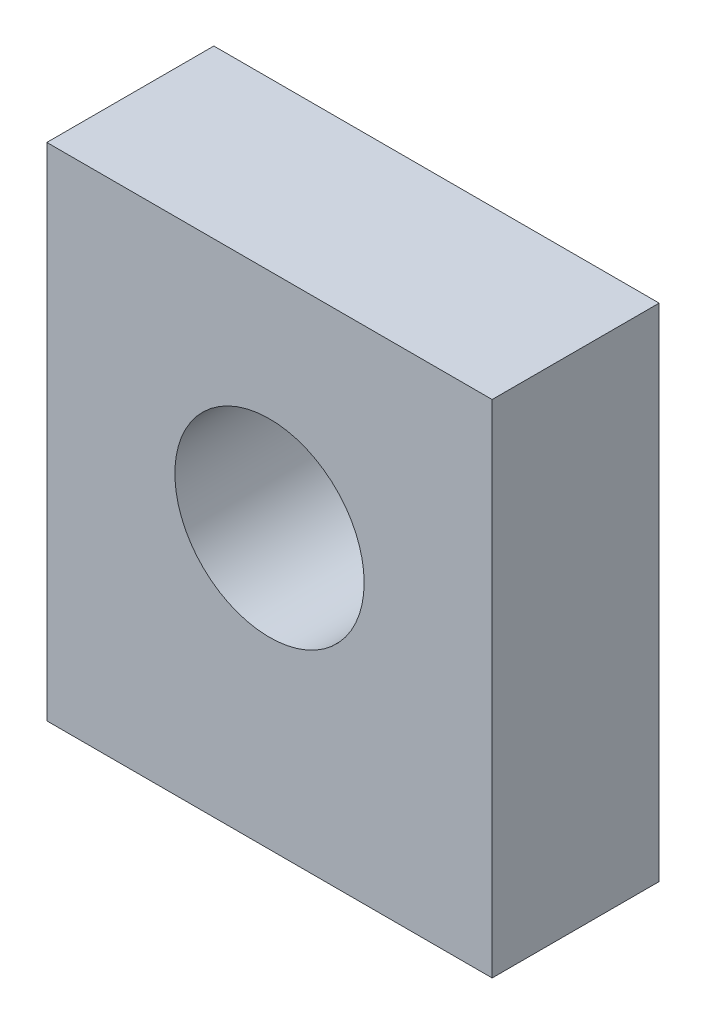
ISO-10303-21;
HEADER;
FILE_DESCRIPTION(('STEP AP214'),'2;1');
FILE_NAME('part.step','',(''),(''),'','','');
FILE_SCHEMA(('AUTOMOTIVE_DESIGN { 1 0 10303 214 1 1 1 1 }'));
ENDSEC;
DATA;
#1=APPLICATION_CONTEXT('core data for automotive mechanical design processes');
#2=APPLICATION_PROTOCOL_DEFINITION('international standard','automotive_design',2000,#1);
#3=PRODUCT_CONTEXT('',#1,'mechanical');
#4=PRODUCT('Part','Part','',(#3));
#5=PRODUCT_RELATED_PRODUCT_CATEGORY('part','',(#4));
#6=PRODUCT_DEFINITION_FORMATION('','',#4);
#7=PRODUCT_DEFINITION_CONTEXT('part definition',#1,'design');
#8=PRODUCT_DEFINITION('design','',#6,#7);
#9=PRODUCT_DEFINITION_SHAPE('','',#8);
#10=(LENGTH_UNIT() NAMED_UNIT(*) SI_UNIT(.MILLI.,.METRE.));
#11=(NAMED_UNIT(*) PLANE_ANGLE_UNIT() SI_UNIT($,.RADIAN.));
#12=(NAMED_UNIT(*) SI_UNIT($,.STERADIAN.) SOLID_ANGLE_UNIT());
#13=UNCERTAINTY_MEASURE_WITH_UNIT(LENGTH_MEASURE(1.E-05),#10,'distance_accuracy_value','');
#14=(GEOMETRIC_REPRESENTATION_CONTEXT(3) GLOBAL_UNCERTAINTY_ASSIGNED_CONTEXT((#13)) GLOBAL_UNIT_ASSIGNED_CONTEXT((#10,
#11,#12)) REPRESENTATION_CONTEXT('',''));
#15=CARTESIAN_POINT('',(0.,0.,0.));
#16=DIRECTION('',(0.,0.,1.));
#17=DIRECTION('',(1.,0.,0.));
#18=AXIS2_PLACEMENT_3D('',#15,#16,#17);
#19=CARTESIAN_POINT('',(0.,0.,3.));
#20=DIRECTION('',(0.,0.,1.));
#21=DIRECTION('',(1.,0.,0.));
#22=AXIS2_PLACEMENT_3D('',#19,#20,#21);
#23=PLANE('',#22);
#24=DIRECTION('',(0.,-1.,0.));
#25=VECTOR('',#24,1.);
#26=CARTESIAN_POINT('',(-4.,4.,3.));
#27=LINE('',#26,#25);
#28=CARTESIAN_POINT('',(-4.,4.,3.));
#29=VERTEX_POINT('',#28);
#30=CARTESIAN_POINT('',(-4.,-5.,3.));
#31=VERTEX_POINT('',#30);
#32=EDGE_CURVE('E95',#29,#31,#27,.T.);
#33=ORIENTED_EDGE('',*,*,#32,.T.);
#34=DIRECTION('',(1.,0.,0.));
#35=VECTOR('',#34,1.);
#36=CARTESIAN_POINT('',(-4.,-5.,3.));
#37=LINE('',#36,#35);
#38=CARTESIAN_POINT('',(4.,-5.,3.));
#39=VERTEX_POINT('',#38);
#40=EDGE_CURVE('E90',#31,#39,#37,.T.);
#41=ORIENTED_EDGE('',*,*,#40,.T.);
#42=DIRECTION('',(0.,1.,0.));
#43=VECTOR('',#42,1.);
#44=CARTESIAN_POINT('',(4.,-5.,3.));
#45=LINE('',#44,#43);
#46=CARTESIAN_POINT('',(4.,4.,3.));
#47=VERTEX_POINT('',#46);
#48=EDGE_CURVE('E93',#39,#47,#45,.T.);
#49=ORIENTED_EDGE('',*,*,#48,.T.);
#50=DIRECTION('',(-1.,0.,0.));
#51=VECTOR('',#50,1.);
#52=CARTESIAN_POINT('',(4.,4.,3.));
#53=LINE('',#52,#51);
#54=EDGE_CURVE('E60',#47,#29,#53,.T.);
#55=ORIENTED_EDGE('',*,*,#54,.T.);
#56=EDGE_LOOP('',(#33,#41,#49,#55));
#57=FACE_BOUND('',#56,.T.);
#58=CARTESIAN_POINT('',(0.,0.,3.));
#59=DIRECTION('',(0.,0.,1.));
#60=DIRECTION('',(1.,0.,0.));
#61=AXIS2_PLACEMENT_3D('',#58,#59,#60);
#62=CIRCLE('',#61,1.7);
#63=CARTESIAN_POINT('',(1.7,0.,3.));
#64=VERTEX_POINT('',#63);
#65=EDGE_CURVE('E110',#64,#64,#62,.T.);
#66=ORIENTED_EDGE('',*,*,#65,.F.);
#67=EDGE_LOOP('',(#66));
#68=FACE_BOUND('',#67,.T.);
#69=ADVANCED_FACE('F43',(#57,#68),#23,.T.);
#70=CARTESIAN_POINT('',(0.,0.,0.));
#71=DIRECTION('',(0.,0.,1.));
#72=DIRECTION('',(1.,0.,0.));
#73=AXIS2_PLACEMENT_3D('',#70,#71,#72);
#74=PLANE('',#73);
#75=DIRECTION('',(0.,-1.,0.));
#76=VECTOR('',#75,1.);
#77=CARTESIAN_POINT('',(-4.,4.,0.));
#78=LINE('',#77,#76);
#79=CARTESIAN_POINT('',(-4.,4.,0.));
#80=VERTEX_POINT('',#79);
#81=CARTESIAN_POINT('',(-4.,-5.,0.));
#82=VERTEX_POINT('',#81);
#83=EDGE_CURVE('E107',#80,#82,#78,.T.);
#84=ORIENTED_EDGE('',*,*,#83,.F.);
#85=DIRECTION('',(-1.,0.,0.));
#86=VECTOR('',#85,1.);
#87=CARTESIAN_POINT('',(4.,4.,0.));
#88=LINE('',#87,#86);
#89=CARTESIAN_POINT('',(4.,4.,0.));
#90=VERTEX_POINT('',#89);
#91=EDGE_CURVE('E83',#90,#80,#88,.T.);
#92=ORIENTED_EDGE('',*,*,#91,.F.);
#93=DIRECTION('',(0.,1.,0.));
#94=VECTOR('',#93,1.);
#95=CARTESIAN_POINT('',(4.,-5.,0.));
#96=LINE('',#95,#94);
#97=CARTESIAN_POINT('',(4.,-5.,0.));
#98=VERTEX_POINT('',#97);
#99=EDGE_CURVE('E77',#98,#90,#96,.T.);
#100=ORIENTED_EDGE('',*,*,#99,.F.);
#101=DIRECTION('',(1.,0.,0.));
#102=VECTOR('',#101,1.);
#103=CARTESIAN_POINT('',(-4.,-5.,0.));
#104=LINE('',#103,#102);
#105=EDGE_CURVE('E99',#82,#98,#104,.T.);
#106=ORIENTED_EDGE('',*,*,#105,.F.);
#107=EDGE_LOOP('',(#84,#92,#100,#106));
#108=FACE_BOUND('',#107,.T.);
#109=CARTESIAN_POINT('',(0.,0.,0.));
#110=DIRECTION('',(0.,0.,1.));
#111=DIRECTION('',(1.,0.,0.));
#112=AXIS2_PLACEMENT_3D('',#109,#110,#111);
#113=CIRCLE('',#112,1.7);
#114=CARTESIAN_POINT('',(1.7,0.,0.));
#115=VERTEX_POINT('',#114);
#116=EDGE_CURVE('E122',#115,#115,#113,.T.);
#117=ORIENTED_EDGE('',*,*,#116,.T.);
#118=EDGE_LOOP('',(#117));
#119=FACE_BOUND('',#118,.T.);
#120=ADVANCED_FACE('F118',(#108,#119),#74,.F.);
#121=CARTESIAN_POINT('',(-4.,4.,3.));
#122=DIRECTION('',(1.,0.,0.));
#123=DIRECTION('',(0.,0.,-1.));
#124=AXIS2_PLACEMENT_3D('',#121,#122,#123);
#125=PLANE('',#124);
#126=ORIENTED_EDGE('',*,*,#83,.T.);
#127=DIRECTION('',(0.,0.,-1.));
#128=VECTOR('',#127,1.);
#129=CARTESIAN_POINT('',(-4.,-5.,3.));
#130=LINE('',#129,#128);
#131=EDGE_CURVE('E11',#31,#82,#130,.T.);
#132=ORIENTED_EDGE('',*,*,#131,.F.);
#133=ORIENTED_EDGE('',*,*,#32,.F.);
#134=DIRECTION('',(0.,0.,-1.));
#135=VECTOR('',#134,1.);
#136=CARTESIAN_POINT('',(-4.,4.,3.));
#137=LINE('',#136,#135);
#138=EDGE_CURVE('E103',#29,#80,#137,.T.);
#139=ORIENTED_EDGE('',*,*,#138,.T.);
#140=EDGE_LOOP('',(#126,#132,#133,#139));
#141=FACE_BOUND('',#140,.T.);
#142=ADVANCED_FACE('F45',(#141),#125,.F.);
#143=CARTESIAN_POINT('',(-4.,-5.,3.));
#144=DIRECTION('',(0.,1.,0.));
#145=DIRECTION('',(0.,0.,1.));
#146=AXIS2_PLACEMENT_3D('',#143,#144,#145);
#147=PLANE('',#146);
#148=ORIENTED_EDGE('',*,*,#105,.T.);
#149=DIRECTION('',(0.,0.,-1.));
#150=VECTOR('',#149,1.);
#151=CARTESIAN_POINT('',(4.,-5.,3.));
#152=LINE('',#151,#150);
#153=EDGE_CURVE('E52',#39,#98,#152,.T.);
#154=ORIENTED_EDGE('',*,*,#153,.F.);
#155=ORIENTED_EDGE('',*,*,#40,.F.);
#156=ORIENTED_EDGE('',*,*,#131,.T.);
#157=EDGE_LOOP('',(#148,#154,#155,#156));
#158=FACE_BOUND('',#157,.T.);
#159=ADVANCED_FACE('F98',(#158),#147,.F.);
#160=CARTESIAN_POINT('',(4.,-5.,3.));
#161=DIRECTION('',(-1.,0.,0.));
#162=DIRECTION('',(0.,0.,1.));
#163=AXIS2_PLACEMENT_3D('',#160,#161,#162);
#164=PLANE('',#163);
#165=ORIENTED_EDGE('',*,*,#99,.T.);
#166=DIRECTION('',(0.,0.,-1.));
#167=VECTOR('',#166,1.);
#168=CARTESIAN_POINT('',(4.,4.,3.));
#169=LINE('',#168,#167);
#170=EDGE_CURVE('E100',#47,#90,#169,.T.);
#171=ORIENTED_EDGE('',*,*,#170,.F.);
#172=ORIENTED_EDGE('',*,*,#48,.F.);
#173=ORIENTED_EDGE('',*,*,#153,.T.);
#174=EDGE_LOOP('',(#165,#171,#172,#173));
#175=FACE_BOUND('',#174,.T.);
#176=ADVANCED_FACE('F101',(#175),#164,.F.);
#177=CARTESIAN_POINT('',(4.,4.,3.));
#178=DIRECTION('',(0.,-1.,0.));
#179=DIRECTION('',(0.,0.,-1.));
#180=AXIS2_PLACEMENT_3D('',#177,#178,#179);
#181=PLANE('',#180);
#182=ORIENTED_EDGE('',*,*,#91,.T.);
#183=ORIENTED_EDGE('',*,*,#138,.F.);
#184=ORIENTED_EDGE('',*,*,#54,.F.);
#185=ORIENTED_EDGE('',*,*,#170,.T.);
#186=EDGE_LOOP('',(#182,#183,#184,#185));
#187=FACE_BOUND('',#186,.T.);
#188=ADVANCED_FACE('F115',(#187),#181,.F.);
#189=CARTESIAN_POINT('',(0.,0.,3.));
#190=DIRECTION('',(0.,0.,-1.));
#191=DIRECTION('',(-1.,0.,0.));
#192=AXIS2_PLACEMENT_3D('',#189,#190,#191);
#193=CYLINDRICAL_SURFACE('',#192,1.7);
#194=ORIENTED_EDGE('',*,*,#65,.T.);
#195=EDGE_LOOP('',(#194));
#196=FACE_BOUND('',#195,.T.);
#197=ORIENTED_EDGE('',*,*,#116,.F.);
#198=EDGE_LOOP('',(#197));
#199=FACE_BOUND('',#198,.T.);
#200=ADVANCED_FACE('F128',(#196,#199),#193,.F.);
#201=CLOSED_SHELL('',(#69,#120,#142,#159,#176,#188,#200));
#202=MANIFOLD_SOLID_BREP('B2',#201);
#203=ADVANCED_BREP_SHAPE_REPRESENTATION('',(#18,#202),#14);
#204=SHAPE_DEFINITION_REPRESENTATION(#9,#203);
ENDSEC;
END-ISO-10303-21;
